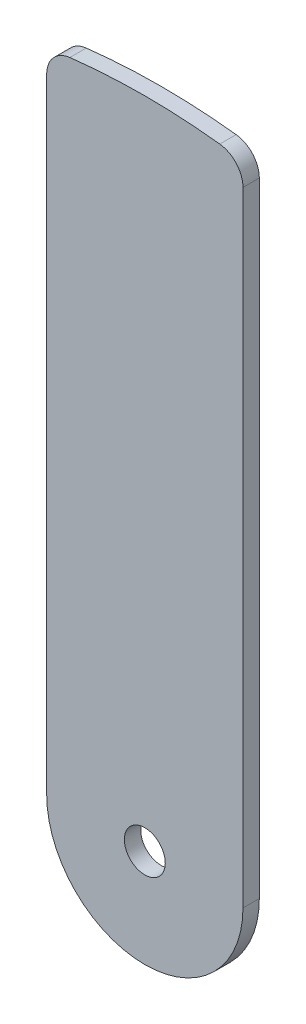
from build123d import *

# Parameters (mm, degrees)
BOSS_EXTRUDE1_DEPTH = 3.175
FILLET1_R           = 5.08


with BuildPart() as part:
    # Sketch1 → Boss-Extrude1 (new body)
    with BuildSketch(Plane.XY):
        with BuildLine():
            Line((-19.05, 125.563121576), (-19.05, 0))
            ThreePointArc((-19.05, 0), (-15.554259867, 10.998522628), (-6.35, 17.960512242))
            Line((-6.35, 17.960512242), (-6.35, 126.841150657))
            ThreePointArc((-6.35, 126.841150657), (-12.716066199, 126.361788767), (-19.05, 125.563121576))
        make_face()
        with BuildLine():
            ThreePointArc((6.35, 17.960512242), (15.554259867, 10.998522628), (19.05, 0))
            Line((19.05, 0), (19.05, 125.563121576))
            ThreePointArc((19.05, 125.563121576), (12.716066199, 126.361788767), (6.35, 126.841150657))
            Line((6.35, 126.841150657), (6.35, 17.960512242))
        make_face()
        with BuildLine():
            ThreePointArc((-6.35, 17.960512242), (0, 19.05), (6.35, 17.960512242))
            Line((6.35, 17.960512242), (6.35, 126.841150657))
            ThreePointArc((6.35, 126.841150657), (3.175993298, 126.960281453), (4.8e-08, 127))
            ThreePointArc((4.8e-08, 127), (-3.175993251, 126.960281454), (-6.35, 126.841150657))
            Line((-6.35, 126.841150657), (-6.35, 17.960512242))
        make_face()
        with BuildLine():
            ThreePointArc((-3.96875, 0), (0, 3.96875), (3.96875, 0))
            Line((3.96875, 0), (19.05, 0))
            ThreePointArc((19.05, 0), (15.554259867, 10.998522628), (6.35, 17.960512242))
            Line((6.35, 17.960512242), (6.35, 12.7))
            ThreePointArc((6.35, 12.7), (0, 6.35), (-6.35, 12.7))
            Line((-6.35, 12.7), (-6.35, 17.960512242))
            ThreePointArc((-6.35, 17.960512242), (-15.554259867, 10.998522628), (-19.05, 0))
            Line((-19.05, 0), (-3.96875, 0))
        make_face()
        with BuildLine():
            Line((-6.35, 12.7), (6.35, 12.7))
            ThreePointArc((6.35, 12.7), (0, 6.35), (-6.35, 12.7))
        make_face()
        with BuildLine():
            Line((6.35, 12.7), (6.35, 17.960512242))
            ThreePointArc((6.35, 17.960512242), (0, 19.05), (-6.35, 17.960512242))
            Line((-6.35, 17.960512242), (-6.35, 12.7))
            Line((-6.35, 12.7), (6.35, 12.7))
        make_face()
        with BuildLine():
            Line((19.05, 0), (3.96875, 0))
            ThreePointArc((3.96875, 0), (0, -3.96875), (-3.96875, 0))
            Line((-3.96875, 0), (-19.05, 0))
            ThreePointArc((-19.05, 0), (0, -19.05), (19.05, 0))
        make_face()
    extrude(amount=BOSS_EXTRUDE1_DEPTH)

    # Fillet1
    fillet1_edges = [part.edges().sort_by_distance(p)[0] for p in [
        (-19.05, 125.563121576, 1.5875),
        (19.05, 125.563121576, 1.5875),
    ]]
    fillet(fillet1_edges, radius=FILLET1_R)


solid = part.part
